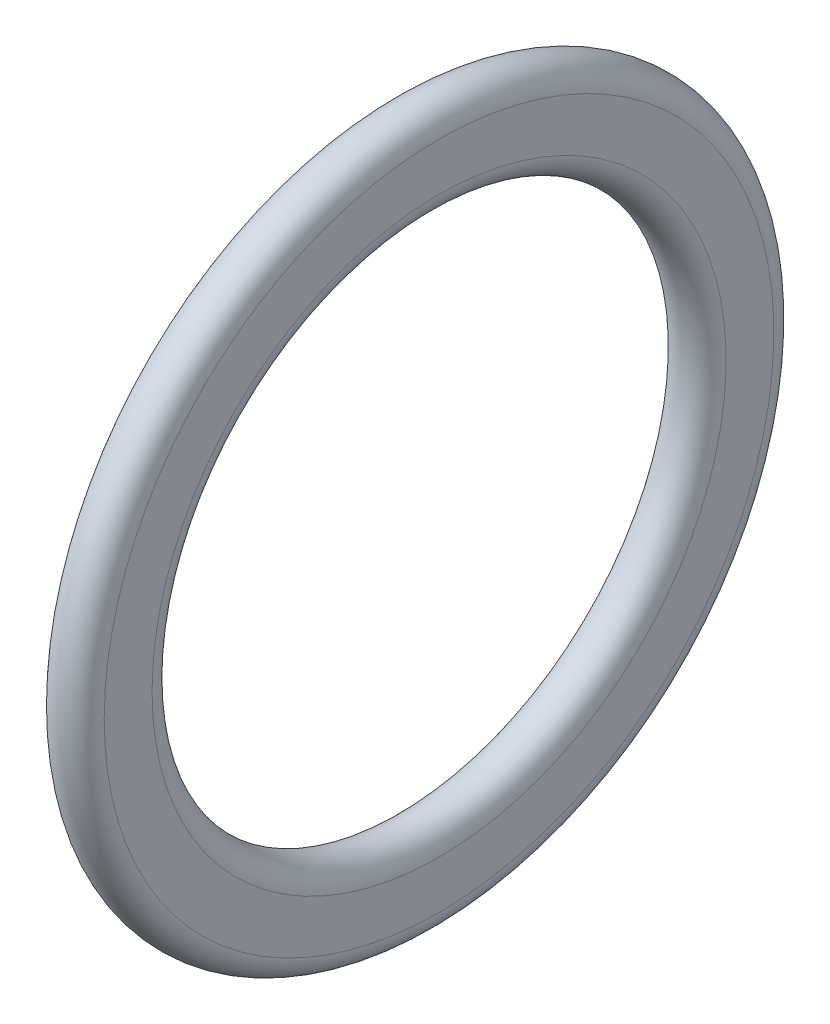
ISO-10303-21;
HEADER;
FILE_DESCRIPTION(('STEP AP214'),'2;1');
FILE_NAME('part.step','',(''),(''),'','','');
FILE_SCHEMA(('AUTOMOTIVE_DESIGN { 1 0 10303 214 1 1 1 1 }'));
ENDSEC;
DATA;
#1=APPLICATION_CONTEXT('core data for automotive mechanical design processes');
#2=APPLICATION_PROTOCOL_DEFINITION('international standard','automotive_design',2000,#1);
#3=PRODUCT_CONTEXT('',#1,'mechanical');
#4=PRODUCT('Part','Part','',(#3));
#5=PRODUCT_RELATED_PRODUCT_CATEGORY('part','',(#4));
#6=PRODUCT_DEFINITION_FORMATION('','',#4);
#7=PRODUCT_DEFINITION_CONTEXT('part definition',#1,'design');
#8=PRODUCT_DEFINITION('design','',#6,#7);
#9=PRODUCT_DEFINITION_SHAPE('','',#8);
#10=(LENGTH_UNIT() NAMED_UNIT(*) SI_UNIT(.MILLI.,.METRE.));
#11=(NAMED_UNIT(*) PLANE_ANGLE_UNIT() SI_UNIT($,.RADIAN.));
#12=(NAMED_UNIT(*) SI_UNIT($,.STERADIAN.) SOLID_ANGLE_UNIT());
#13=UNCERTAINTY_MEASURE_WITH_UNIT(LENGTH_MEASURE(1.E-05),#10,'distance_accuracy_value','');
#14=(GEOMETRIC_REPRESENTATION_CONTEXT(3) GLOBAL_UNCERTAINTY_ASSIGNED_CONTEXT((#13)) GLOBAL_UNIT_ASSIGNED_CONTEXT((#10,
#11,#12)) REPRESENTATION_CONTEXT('',''));
#15=CARTESIAN_POINT('',(0.,0.,0.));
#16=DIRECTION('',(0.,0.,1.));
#17=DIRECTION('',(1.,0.,0.));
#18=AXIS2_PLACEMENT_3D('',#15,#16,#17);
#19=CARTESIAN_POINT('',(0.,0.,0.));
#20=DIRECTION('',(-1.,0.,0.));
#21=DIRECTION('',(0.,0.,1.));
#22=AXIS2_PLACEMENT_3D('',#19,#20,#21);
#23=TOROIDAL_SURFACE('',#22,7.,0.5);
#24=CARTESIAN_POINT('',(-0.5,0.,0.));
#25=DIRECTION('',(-1.,0.,0.));
#26=DIRECTION('',(0.,0.,1.));
#27=AXIS2_PLACEMENT_3D('',#24,#25,#26);
#28=CIRCLE('',#27,7.);
#29=CARTESIAN_POINT('',(-0.5,0.,7.));
#30=VERTEX_POINT('',#29);
#31=EDGE_CURVE('E45',#30,#30,#28,.T.);
#32=ORIENTED_EDGE('',*,*,#31,.F.);
#33=EDGE_LOOP('',(#32));
#34=FACE_BOUND('',#33,.T.);
#35=CARTESIAN_POINT('',(0.5,0.,0.));
#36=DIRECTION('',(-1.,0.,0.));
#37=DIRECTION('',(0.,0.,1.));
#38=AXIS2_PLACEMENT_3D('',#35,#36,#37);
#39=CIRCLE('',#38,7.);
#40=CARTESIAN_POINT('',(0.5,0.,7.));
#41=VERTEX_POINT('',#40);
#42=EDGE_CURVE('E10',#41,#41,#39,.T.);
#43=ORIENTED_EDGE('',*,*,#42,.T.);
#44=EDGE_LOOP('',(#43));
#45=FACE_BOUND('',#44,.T.);
#46=ADVANCED_FACE('F31',(#34,#45),#23,.T.);
#47=CARTESIAN_POINT('',(0.5,7.,0.));
#48=DIRECTION('',(-1.,0.,0.));
#49=DIRECTION('',(0.,0.,1.));
#50=AXIS2_PLACEMENT_3D('',#47,#48,#49);
#51=PLANE('',#50);
#52=ORIENTED_EDGE('',*,*,#42,.F.);
#53=EDGE_LOOP('',(#52));
#54=FACE_BOUND('',#53,.T.);
#55=CARTESIAN_POINT('',(0.5,0.,0.));
#56=DIRECTION('',(-1.,0.,0.));
#57=DIRECTION('',(0.,0.,1.));
#58=AXIS2_PLACEMENT_3D('',#55,#56,#57);
#59=CIRCLE('',#58,6.);
#60=CARTESIAN_POINT('',(0.5,0.,6.));
#61=VERTEX_POINT('',#60);
#62=EDGE_CURVE('E37',#61,#61,#59,.T.);
#63=ORIENTED_EDGE('',*,*,#62,.T.);
#64=EDGE_LOOP('',(#63));
#65=FACE_BOUND('',#64,.T.);
#66=ADVANCED_FACE('F54',(#54,#65),#51,.F.);
#67=CARTESIAN_POINT('',(0.,0.,0.));
#68=DIRECTION('',(-1.,0.,0.));
#69=DIRECTION('',(0.,0.,1.));
#70=AXIS2_PLACEMENT_3D('',#67,#68,#69);
#71=TOROIDAL_SURFACE('',#70,6.,0.5);
#72=ORIENTED_EDGE('',*,*,#62,.F.);
#73=EDGE_LOOP('',(#72));
#74=FACE_BOUND('',#73,.T.);
#75=CARTESIAN_POINT('',(-0.5,0.,0.));
#76=DIRECTION('',(-1.,0.,0.));
#77=DIRECTION('',(0.,0.,1.));
#78=AXIS2_PLACEMENT_3D('',#75,#76,#77);
#79=CIRCLE('',#78,6.);
#80=CARTESIAN_POINT('',(-0.5,0.,6.));
#81=VERTEX_POINT('',#80);
#82=EDGE_CURVE('E41',#81,#81,#79,.T.);
#83=ORIENTED_EDGE('',*,*,#82,.T.);
#84=EDGE_LOOP('',(#83));
#85=FACE_BOUND('',#84,.T.);
#86=ADVANCED_FACE('F58',(#74,#85),#71,.T.);
#87=CARTESIAN_POINT('',(-0.5,7.,0.));
#88=DIRECTION('',(1.,0.,0.));
#89=DIRECTION('',(0.,0.,-1.));
#90=AXIS2_PLACEMENT_3D('',#87,#88,#89);
#91=PLANE('',#90);
#92=ORIENTED_EDGE('',*,*,#82,.F.);
#93=EDGE_LOOP('',(#92));
#94=FACE_BOUND('',#93,.T.);
#95=ORIENTED_EDGE('',*,*,#31,.T.);
#96=EDGE_LOOP('',(#95));
#97=FACE_BOUND('',#96,.T.);
#98=ADVANCED_FACE('F51',(#94,#97),#91,.F.);
#99=CLOSED_SHELL('',(#46,#66,#86,#98));
#100=MANIFOLD_SOLID_BREP('B2',#99);
#101=ADVANCED_BREP_SHAPE_REPRESENTATION('',(#18,#100),#14);
#102=SHAPE_DEFINITION_REPRESENTATION(#9,#101);
ENDSEC;
END-ISO-10303-21;
